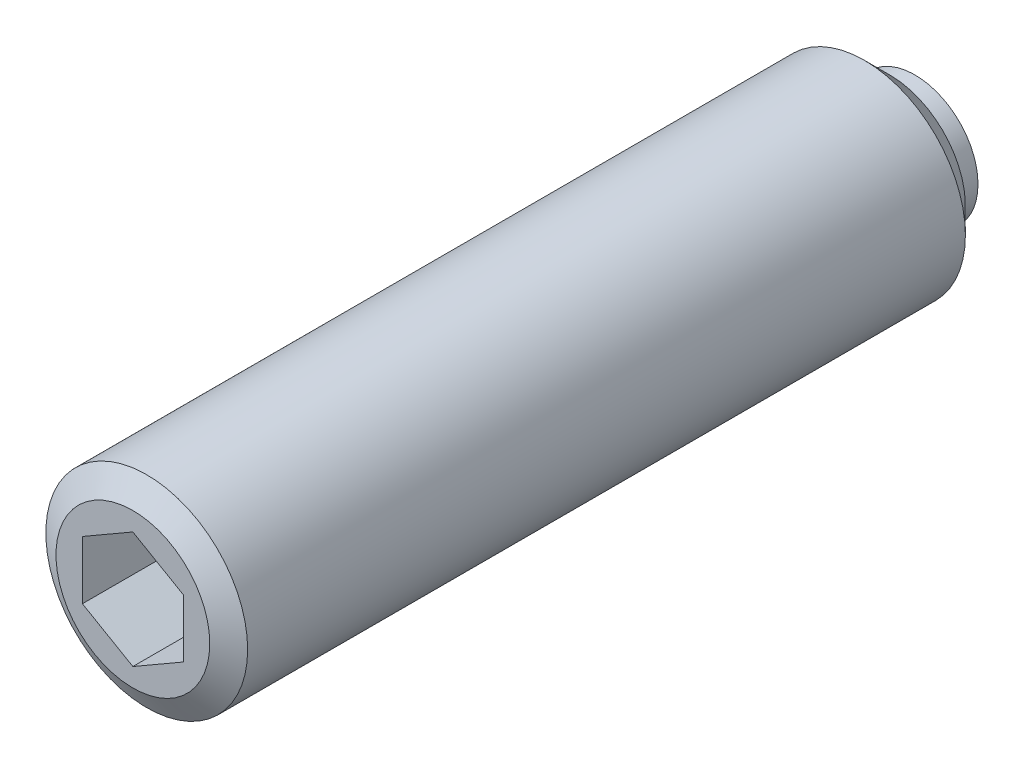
ISO-10303-21;
HEADER;
FILE_DESCRIPTION(('STEP AP214'),'2;1');
FILE_NAME('part.step','',(''),(''),'','','');
FILE_SCHEMA(('AUTOMOTIVE_DESIGN { 1 0 10303 214 1 1 1 1 }'));
ENDSEC;
DATA;
#1=APPLICATION_CONTEXT('core data for automotive mechanical design processes');
#2=APPLICATION_PROTOCOL_DEFINITION('international standard','automotive_design',2000,#1);
#3=PRODUCT_CONTEXT('',#1,'mechanical');
#4=PRODUCT('Part','Part','',(#3));
#5=PRODUCT_RELATED_PRODUCT_CATEGORY('part','',(#4));
#6=PRODUCT_DEFINITION_FORMATION('','',#4);
#7=PRODUCT_DEFINITION_CONTEXT('part definition',#1,'design');
#8=PRODUCT_DEFINITION('design','',#6,#7);
#9=PRODUCT_DEFINITION_SHAPE('','',#8);
#10=(LENGTH_UNIT() NAMED_UNIT(*) SI_UNIT(.MILLI.,.METRE.));
#11=(NAMED_UNIT(*) PLANE_ANGLE_UNIT() SI_UNIT($,.RADIAN.));
#12=(NAMED_UNIT(*) SI_UNIT($,.STERADIAN.) SOLID_ANGLE_UNIT());
#13=UNCERTAINTY_MEASURE_WITH_UNIT(LENGTH_MEASURE(1.E-05),#10,'distance_accuracy_value','');
#14=(GEOMETRIC_REPRESENTATION_CONTEXT(3) GLOBAL_UNCERTAINTY_ASSIGNED_CONTEXT((#13)) GLOBAL_UNIT_ASSIGNED_CONTEXT((#10,
#11,#12)) REPRESENTATION_CONTEXT('',''));
#15=CARTESIAN_POINT('',(0.,0.,0.));
#16=DIRECTION('',(0.,0.,1.));
#17=DIRECTION('',(1.,0.,0.));
#18=AXIS2_PLACEMENT_3D('',#15,#16,#17);
#19=CARTESIAN_POINT('',(5.,0.,0.));
#20=DIRECTION('',(0.,0.,-1.));
#21=DIRECTION('',(-1.,0.,0.));
#22=AXIS2_PLACEMENT_3D('',#19,#20,#21);
#23=PLANE('',#22);
#24=CARTESIAN_POINT('',(0.,0.,0.));
#25=DIRECTION('',(0.,0.,1.));
#26=DIRECTION('',(1.,0.,0.));
#27=AXIS2_PLACEMENT_3D('',#24,#25,#26);
#28=CIRCLE('',#27,5.);
#29=CARTESIAN_POINT('',(5.,0.,0.));
#30=VERTEX_POINT('',#29);
#31=EDGE_CURVE('E124',#30,#30,#28,.T.);
#32=ORIENTED_EDGE('',*,*,#31,.F.);
#33=EDGE_LOOP('',(#32));
#34=FACE_BOUND('',#33,.T.);
#35=ADVANCED_FACE('F14',(#34),#23,.T.);
#36=CARTESIAN_POINT('',(0.,0.,82.));
#37=DIRECTION('',(0.,0.,1.));
#38=DIRECTION('',(1.,0.,0.));
#39=AXIS2_PLACEMENT_3D('',#36,#37,#38);
#40=CYLINDRICAL_SURFACE('',#39,5.);
#41=CARTESIAN_POINT('',(0.,0.,2.));
#42=DIRECTION('',(0.,0.,1.));
#43=DIRECTION('',(1.,0.,0.));
#44=AXIS2_PLACEMENT_3D('',#41,#42,#43);
#45=CIRCLE('',#44,5.);
#46=CARTESIAN_POINT('',(5.,0.,2.));
#47=VERTEX_POINT('',#46);
#48=EDGE_CURVE('E121',#47,#47,#45,.T.);
#49=ORIENTED_EDGE('',*,*,#48,.F.);
#50=EDGE_LOOP('',(#49));
#51=FACE_BOUND('',#50,.T.);
#52=ORIENTED_EDGE('',*,*,#31,.T.);
#53=EDGE_LOOP('',(#52));
#54=FACE_BOUND('',#53,.T.);
#55=ADVANCED_FACE('F149',(#51,#54),#40,.T.);
#56=CARTESIAN_POINT('',(8.,0.,2.));
#57=DIRECTION('',(0.,0.,-1.));
#58=DIRECTION('',(-1.,0.,0.));
#59=AXIS2_PLACEMENT_3D('',#56,#57,#58);
#60=PLANE('',#59);
#61=CARTESIAN_POINT('',(0.,0.,2.));
#62=DIRECTION('',(0.,0.,-1.));
#63=DIRECTION('',(-1.,0.,0.));
#64=AXIS2_PLACEMENT_3D('',#61,#62,#63);
#65=CIRCLE('',#64,6.);
#66=CARTESIAN_POINT('',(-6.,0.,2.));
#67=VERTEX_POINT('',#66);
#68=EDGE_CURVE('E130',#67,#67,#65,.T.);
#69=ORIENTED_EDGE('',*,*,#68,.T.);
#70=EDGE_LOOP('',(#69));
#71=FACE_BOUND('',#70,.T.);
#72=ORIENTED_EDGE('',*,*,#48,.T.);
#73=EDGE_LOOP('',(#72));
#74=FACE_BOUND('',#73,.T.);
#75=ADVANCED_FACE('F155',(#71,#74),#60,.T.);
#76=CARTESIAN_POINT('',(0.,0.,82.));
#77=DIRECTION('',(0.,0.,1.));
#78=DIRECTION('',(1.,0.,0.));
#79=AXIS2_PLACEMENT_3D('',#76,#77,#78);
#80=CYLINDRICAL_SURFACE('',#79,8.);
#81=CARTESIAN_POINT('',(0.,0.,60.9));
#82=DIRECTION('',(0.,0.,1.));
#83=DIRECTION('',(1.,0.,0.));
#84=AXIS2_PLACEMENT_3D('',#81,#82,#83);
#85=CIRCLE('',#84,8.);
#86=CARTESIAN_POINT('',(8.,0.,60.9));
#87=VERTEX_POINT('',#86);
#88=EDGE_CURVE('E9',#87,#87,#85,.F.);
#89=ORIENTED_EDGE('',*,*,#88,.T.);
#90=EDGE_LOOP('',(#89));
#91=FACE_BOUND('',#90,.T.);
#92=CARTESIAN_POINT('',(0.,0.,4.));
#93=DIRECTION('',(0.,0.,-1.));
#94=DIRECTION('',(-1.,0.,0.));
#95=AXIS2_PLACEMENT_3D('',#92,#93,#94);
#96=CIRCLE('',#95,8.);
#97=CARTESIAN_POINT('',(-8.,0.,4.));
#98=VERTEX_POINT('',#97);
#99=EDGE_CURVE('E127',#98,#98,#96,.F.);
#100=ORIENTED_EDGE('',*,*,#99,.T.);
#101=EDGE_LOOP('',(#100));
#102=FACE_BOUND('',#101,.T.);
#103=ADVANCED_FACE('F162',(#91,#102),#80,.T.);
#104=CARTESIAN_POINT('',(0.,0.,62.));
#105=DIRECTION('',(0.,0.,1.));
#106=DIRECTION('',(1.,0.,0.));
#107=AXIS2_PLACEMENT_3D('',#104,#105,#106);
#108=PLANE('',#107);
#109=CARTESIAN_POINT('',(0.,0.,62.));
#110=DIRECTION('',(0.,0.,1.));
#111=DIRECTION('',(1.,0.,0.));
#112=AXIS2_PLACEMENT_3D('',#109,#110,#111);
#113=CIRCLE('',#112,6.09474411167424);
#114=CARTESIAN_POINT('',(6.09474411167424,0.,62.));
#115=VERTEX_POINT('',#114);
#116=EDGE_CURVE('E22',#115,#115,#113,.T.);
#117=ORIENTED_EDGE('',*,*,#116,.T.);
#118=EDGE_LOOP('',(#117));
#119=FACE_BOUND('',#118,.T.);
#120=DIRECTION('',(0.86602540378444,-0.5,0.));
#121=VECTOR('',#120,1.);
#122=CARTESIAN_POINT('',(-4.,-2.30940107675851,62.));
#123=LINE('',#122,#121);
#124=CARTESIAN_POINT('',(-4.,-2.30940107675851,62.));
#125=VERTEX_POINT('',#124);
#126=CARTESIAN_POINT('',(0.,-4.618802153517,62.));
#127=VERTEX_POINT('',#126);
#128=EDGE_CURVE('E29',#125,#127,#123,.T.);
#129=ORIENTED_EDGE('',*,*,#128,.F.);
#130=DIRECTION('',(0.,-1.,0.));
#131=VECTOR('',#130,1.);
#132=CARTESIAN_POINT('',(-4.,2.30940107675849,62.));
#133=LINE('',#132,#131);
#134=CARTESIAN_POINT('',(-4.,2.30940107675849,62.));
#135=VERTEX_POINT('',#134);
#136=EDGE_CURVE('E97',#135,#125,#133,.T.);
#137=ORIENTED_EDGE('',*,*,#136,.F.);
#138=DIRECTION('',(0.866025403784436,0.5,0.));
#139=VECTOR('',#138,1.);
#140=CARTESIAN_POINT('',(-4.,2.30940107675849,62.));
#141=LINE('',#140,#139);
#142=CARTESIAN_POINT('',(0.,4.61880215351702,62.));
#143=VERTEX_POINT('',#142);
#144=EDGE_CURVE('E92',#135,#143,#141,.T.);
#145=ORIENTED_EDGE('',*,*,#144,.T.);
#146=DIRECTION('',(-0.866025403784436,0.5,0.));
#147=VECTOR('',#146,1.);
#148=CARTESIAN_POINT('',(4.,2.30940107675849,62.));
#149=LINE('',#148,#147);
#150=CARTESIAN_POINT('',(4.,2.30940107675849,62.));
#151=VERTEX_POINT('',#150);
#152=EDGE_CURVE('E90',#151,#143,#149,.T.);
#153=ORIENTED_EDGE('',*,*,#152,.F.);
#154=DIRECTION('',(0.,-1.,0.));
#155=VECTOR('',#154,1.);
#156=CARTESIAN_POINT('',(4.,2.30940107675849,62.));
#157=LINE('',#156,#155);
#158=CARTESIAN_POINT('',(4.,-2.30940107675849,62.));
#159=VERTEX_POINT('',#158);
#160=EDGE_CURVE('E72',#151,#159,#157,.T.);
#161=ORIENTED_EDGE('',*,*,#160,.T.);
#162=DIRECTION('',(-0.866025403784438,-0.5,0.));
#163=VECTOR('',#162,1.);
#164=CARTESIAN_POINT('',(4.,-2.30940107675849,62.));
#165=LINE('',#164,#163);
#166=EDGE_CURVE('E83',#159,#127,#165,.T.);
#167=ORIENTED_EDGE('',*,*,#166,.T.);
#168=EDGE_LOOP('',(#129,#137,#145,#153,#161,#167));
#169=FACE_BOUND('',#168,.T.);
#170=ADVANCED_FACE('F87',(#119,#169),#108,.T.);
#171=CARTESIAN_POINT('',(-4.,-2.30940107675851,56.));
#172=DIRECTION('',(-0.5,-0.86602540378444,0.));
#173=DIRECTION('',(-0.86602540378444,0.5,0.));
#174=AXIS2_PLACEMENT_3D('',#171,#172,#173);
#175=PLANE('',#174);
#176=DIRECTION('',(0.,0.,1.));
#177=VECTOR('',#176,1.);
#178=CARTESIAN_POINT('',(-4.,-2.30940107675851,56.));
#179=LINE('',#178,#177);
#180=CARTESIAN_POINT('',(-4.,-2.30940107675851,56.));
#181=VERTEX_POINT('',#180);
#182=EDGE_CURVE('E36',#181,#125,#179,.T.);
#183=ORIENTED_EDGE('',*,*,#182,.T.);
#184=ORIENTED_EDGE('',*,*,#128,.T.);
#185=DIRECTION('',(0.,0.,1.));
#186=VECTOR('',#185,1.);
#187=CARTESIAN_POINT('',(0.,-4.618802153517,56.));
#188=LINE('',#187,#186);
#189=CARTESIAN_POINT('',(0.,-4.618802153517,56.));
#190=VERTEX_POINT('',#189);
#191=EDGE_CURVE('E80',#190,#127,#188,.T.);
#192=ORIENTED_EDGE('',*,*,#191,.F.);
#193=DIRECTION('',(0.86602540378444,-0.5,0.));
#194=VECTOR('',#193,1.);
#195=CARTESIAN_POINT('',(-4.,-2.30940107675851,56.));
#196=LINE('',#195,#194);
#197=EDGE_CURVE('E99',#181,#190,#196,.T.);
#198=ORIENTED_EDGE('',*,*,#197,.F.);
#199=EDGE_LOOP('',(#183,#184,#192,#198));
#200=FACE_BOUND('',#199,.T.);
#201=ADVANCED_FACE('F169',(#200),#175,.F.);
#202=CARTESIAN_POINT('',(-4.,2.30940107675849,56.));
#203=DIRECTION('',(-1.,0.,0.));
#204=DIRECTION('',(0.,0.,1.));
#205=AXIS2_PLACEMENT_3D('',#202,#203,#204);
#206=PLANE('',#205);
#207=DIRECTION('',(0.,0.,1.));
#208=VECTOR('',#207,1.);
#209=CARTESIAN_POINT('',(-4.,2.30940107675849,56.));
#210=LINE('',#209,#208);
#211=CARTESIAN_POINT('',(-4.,2.30940107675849,56.));
#212=VERTEX_POINT('',#211);
#213=EDGE_CURVE('E118',#212,#135,#210,.T.);
#214=ORIENTED_EDGE('',*,*,#213,.T.);
#215=ORIENTED_EDGE('',*,*,#136,.T.);
#216=ORIENTED_EDGE('',*,*,#182,.F.);
#217=DIRECTION('',(0.,-1.,0.));
#218=VECTOR('',#217,1.);
#219=CARTESIAN_POINT('',(-4.,2.30940107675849,56.));
#220=LINE('',#219,#218);
#221=EDGE_CURVE('E111',#212,#181,#220,.T.);
#222=ORIENTED_EDGE('',*,*,#221,.F.);
#223=EDGE_LOOP('',(#214,#215,#216,#222));
#224=FACE_BOUND('',#223,.T.);
#225=ADVANCED_FACE('F170',(#224),#206,.F.);
#226=CARTESIAN_POINT('',(-4.,2.30940107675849,56.));
#227=DIRECTION('',(0.5,-0.866025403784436,0.));
#228=DIRECTION('',(-0.866025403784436,-0.5,0.));
#229=AXIS2_PLACEMENT_3D('',#226,#227,#228);
#230=PLANE('',#229);
#231=DIRECTION('',(0.,0.,1.));
#232=VECTOR('',#231,1.);
#233=CARTESIAN_POINT('',(0.,4.61880215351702,56.));
#234=LINE('',#233,#232);
#235=CARTESIAN_POINT('',(0.,4.61880215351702,56.));
#236=VERTEX_POINT('',#235);
#237=EDGE_CURVE('E116',#236,#143,#234,.T.);
#238=ORIENTED_EDGE('',*,*,#237,.T.);
#239=ORIENTED_EDGE('',*,*,#144,.F.);
#240=ORIENTED_EDGE('',*,*,#213,.F.);
#241=DIRECTION('',(0.866025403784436,0.5,0.));
#242=VECTOR('',#241,1.);
#243=CARTESIAN_POINT('',(-4.,2.30940107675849,56.));
#244=LINE('',#243,#242);
#245=EDGE_CURVE('E108',#212,#236,#244,.T.);
#246=ORIENTED_EDGE('',*,*,#245,.T.);
#247=EDGE_LOOP('',(#238,#239,#240,#246));
#248=FACE_BOUND('',#247,.T.);
#249=ADVANCED_FACE('F173',(#248),#230,.T.);
#250=CARTESIAN_POINT('',(4.,2.30940107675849,56.));
#251=DIRECTION('',(0.5,0.866025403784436,0.));
#252=DIRECTION('',(0.866025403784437,-0.5,0.));
#253=AXIS2_PLACEMENT_3D('',#250,#251,#252);
#254=PLANE('',#253);
#255=DIRECTION('',(0.,0.,1.));
#256=VECTOR('',#255,1.);
#257=CARTESIAN_POINT('',(4.,2.30940107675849,56.));
#258=LINE('',#257,#256);
#259=CARTESIAN_POINT('',(4.,2.30940107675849,56.));
#260=VERTEX_POINT('',#259);
#261=EDGE_CURVE('E79',#260,#151,#258,.T.);
#262=ORIENTED_EDGE('',*,*,#261,.T.);
#263=ORIENTED_EDGE('',*,*,#152,.T.);
#264=ORIENTED_EDGE('',*,*,#237,.F.);
#265=DIRECTION('',(-0.866025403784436,0.5,0.));
#266=VECTOR('',#265,1.);
#267=CARTESIAN_POINT('',(4.,2.30940107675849,56.));
#268=LINE('',#267,#266);
#269=EDGE_CURVE('E105',#260,#236,#268,.T.);
#270=ORIENTED_EDGE('',*,*,#269,.F.);
#271=EDGE_LOOP('',(#262,#263,#264,#270));
#272=FACE_BOUND('',#271,.T.);
#273=ADVANCED_FACE('F176',(#272),#254,.F.);
#274=CARTESIAN_POINT('',(4.,2.30940107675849,56.));
#275=DIRECTION('',(-1.,0.,0.));
#276=DIRECTION('',(0.,0.,1.));
#277=AXIS2_PLACEMENT_3D('',#274,#275,#276);
#278=PLANE('',#277);
#279=DIRECTION('',(0.,0.,1.));
#280=VECTOR('',#279,1.);
#281=CARTESIAN_POINT('',(4.,-2.30940107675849,56.));
#282=LINE('',#281,#280);
#283=CARTESIAN_POINT('',(4.,-2.30940107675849,56.));
#284=VERTEX_POINT('',#283);
#285=EDGE_CURVE('E68',#284,#159,#282,.T.);
#286=ORIENTED_EDGE('',*,*,#285,.T.);
#287=ORIENTED_EDGE('',*,*,#160,.F.);
#288=ORIENTED_EDGE('',*,*,#261,.F.);
#289=DIRECTION('',(0.,-1.,0.));
#290=VECTOR('',#289,1.);
#291=CARTESIAN_POINT('',(4.,2.30940107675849,56.));
#292=LINE('',#291,#290);
#293=EDGE_CURVE('E75',#260,#284,#292,.T.);
#294=ORIENTED_EDGE('',*,*,#293,.T.);
#295=EDGE_LOOP('',(#286,#287,#288,#294));
#296=FACE_BOUND('',#295,.T.);
#297=ADVANCED_FACE('F70',(#296),#278,.T.);
#298=CARTESIAN_POINT('',(4.,-2.30940107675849,56.));
#299=DIRECTION('',(-0.5,0.866025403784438,0.));
#300=DIRECTION('',(0.866025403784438,0.5,0.));
#301=AXIS2_PLACEMENT_3D('',#298,#299,#300);
#302=PLANE('',#301);
#303=DIRECTION('',(-0.866025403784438,-0.5,0.));
#304=VECTOR('',#303,1.);
#305=CARTESIAN_POINT('',(4.,-2.30940107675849,56.));
#306=LINE('',#305,#304);
#307=EDGE_CURVE('E102',#284,#190,#306,.T.);
#308=ORIENTED_EDGE('',*,*,#307,.T.);
#309=ORIENTED_EDGE('',*,*,#191,.T.);
#310=ORIENTED_EDGE('',*,*,#166,.F.);
#311=ORIENTED_EDGE('',*,*,#285,.F.);
#312=EDGE_LOOP('',(#308,#309,#310,#311));
#313=FACE_BOUND('',#312,.T.);
#314=ADVANCED_FACE('F84',(#313),#302,.T.);
#315=CARTESIAN_POINT('',(-8.,0.,56.));
#316=DIRECTION('',(0.,0.,1.));
#317=DIRECTION('',(1.,0.,0.));
#318=AXIS2_PLACEMENT_3D('',#315,#316,#317);
#319=PLANE('',#318);
#320=ORIENTED_EDGE('',*,*,#197,.T.);
#321=ORIENTED_EDGE('',*,*,#307,.F.);
#322=ORIENTED_EDGE('',*,*,#293,.F.);
#323=ORIENTED_EDGE('',*,*,#269,.T.);
#324=ORIENTED_EDGE('',*,*,#245,.F.);
#325=ORIENTED_EDGE('',*,*,#221,.T.);
#326=EDGE_LOOP('',(#320,#321,#322,#323,#324,#325));
#327=FACE_BOUND('',#326,.T.);
#328=ADVANCED_FACE('F144',(#327),#319,.T.);
#329=CARTESIAN_POINT('',(0.,0.,4.));
#330=DIRECTION('',(0.,0.,1.));
#331=DIRECTION('',(1.,0.,0.));
#332=AXIS2_PLACEMENT_3D('',#329,#330,#331);
#333=CONICAL_SURFACE('',#332,8.,0.785398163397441);
#334=ORIENTED_EDGE('',*,*,#68,.F.);
#335=EDGE_LOOP('',(#334));
#336=FACE_BOUND('',#335,.T.);
#337=ORIENTED_EDGE('',*,*,#99,.F.);
#338=EDGE_LOOP('',(#337));
#339=FACE_BOUND('',#338,.T.);
#340=ADVANCED_FACE('F137',(#336,#339),#333,.T.);
#341=CARTESIAN_POINT('',(0.,0.,62.));
#342=DIRECTION('',(0.,0.,-1.));
#343=DIRECTION('',(-1.,0.,0.));
#344=AXIS2_PLACEMENT_3D('',#341,#342,#343);
#345=CONICAL_SURFACE('',#344,6.09474411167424,1.0471975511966);
#346=ORIENTED_EDGE('',*,*,#88,.F.);
#347=EDGE_LOOP('',(#346));
#348=FACE_BOUND('',#347,.T.);
#349=ORIENTED_EDGE('',*,*,#116,.F.);
#350=EDGE_LOOP('',(#349));
#351=FACE_BOUND('',#350,.T.);
#352=ADVANCED_FACE('F16',(#348,#351),#345,.T.);
#353=CLOSED_SHELL('',(#35,#55,#75,#103,#170,#201,#225,#249,#273,#297,#314,#328,#340,#352));
#354=MANIFOLD_SOLID_BREP('B1',#353);
#355=ADVANCED_BREP_SHAPE_REPRESENTATION('',(#18,#354),#14);
#356=SHAPE_DEFINITION_REPRESENTATION(#9,#355);
ENDSEC;
END-ISO-10303-21;
